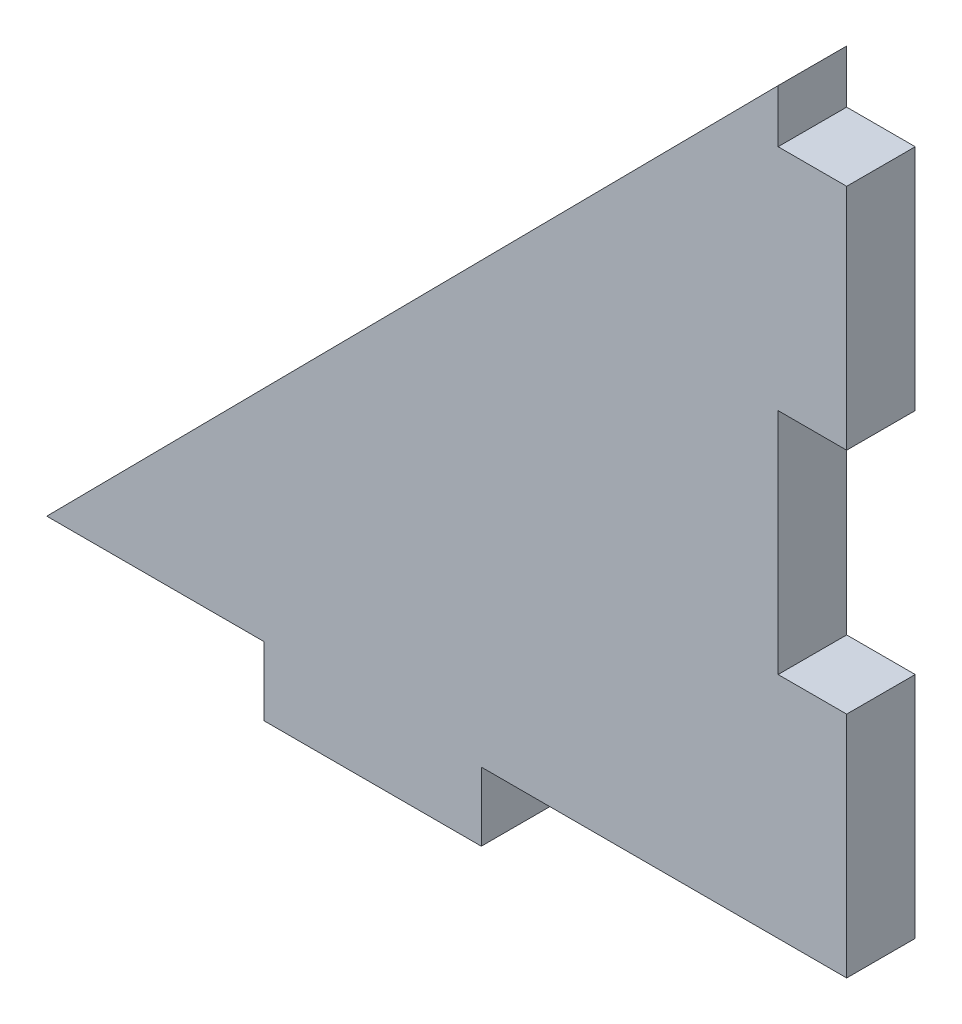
ISO-10303-21;
HEADER;
FILE_DESCRIPTION(('STEP AP214'),'2;1');
FILE_NAME('part.step','',(''),(''),'','','');
FILE_SCHEMA(('AUTOMOTIVE_DESIGN { 1 0 10303 214 1 1 1 1 }'));
ENDSEC;
DATA;
#1=APPLICATION_CONTEXT('core data for automotive mechanical design processes');
#2=APPLICATION_PROTOCOL_DEFINITION('international standard','automotive_design',2000,#1);
#3=PRODUCT_CONTEXT('',#1,'mechanical');
#4=PRODUCT('Part','Part','',(#3));
#5=PRODUCT_RELATED_PRODUCT_CATEGORY('part','',(#4));
#6=PRODUCT_DEFINITION_FORMATION('','',#4);
#7=PRODUCT_DEFINITION_CONTEXT('part definition',#1,'design');
#8=PRODUCT_DEFINITION('design','',#6,#7);
#9=PRODUCT_DEFINITION_SHAPE('','',#8);
#10=(LENGTH_UNIT() NAMED_UNIT(*) SI_UNIT(.MILLI.,.METRE.));
#11=(NAMED_UNIT(*) PLANE_ANGLE_UNIT() SI_UNIT($,.RADIAN.));
#12=(NAMED_UNIT(*) SI_UNIT($,.STERADIAN.) SOLID_ANGLE_UNIT());
#13=UNCERTAINTY_MEASURE_WITH_UNIT(LENGTH_MEASURE(1.E-05),#10,'distance_accuracy_value','');
#14=(GEOMETRIC_REPRESENTATION_CONTEXT(3) GLOBAL_UNCERTAINTY_ASSIGNED_CONTEXT((#13)) GLOBAL_UNIT_ASSIGNED_CONTEXT((#10,
#11,#12)) REPRESENTATION_CONTEXT('',''));
#15=CARTESIAN_POINT('',(0.,0.,0.));
#16=DIRECTION('',(0.,0.,1.));
#17=DIRECTION('',(1.,0.,0.));
#18=AXIS2_PLACEMENT_3D('',#15,#16,#17);
#19=CARTESIAN_POINT('',(0.,40.3163641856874,3.));
#20=DIRECTION('',(0.710576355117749,-0.703620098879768,0.));
#21=DIRECTION('',(0.703620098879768,0.710576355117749,0.));
#22=AXIS2_PLACEMENT_3D('',#19,#20,#21);
#23=PLANE('',#22);
#24=DIRECTION('',(-0.703620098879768,-0.710576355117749,0.));
#25=VECTOR('',#24,1.);
#26=CARTESIAN_POINT('',(0.,40.3163641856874,0.));
#27=LINE('',#26,#25);
#28=CARTESIAN_POINT('',(0.,40.3163641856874,0.));
#29=VERTEX_POINT('',#28);
#30=CARTESIAN_POINT('',(-32.,7.99999999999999,0.));
#31=VERTEX_POINT('',#30);
#32=EDGE_CURVE('E159',#29,#31,#27,.T.);
#33=ORIENTED_EDGE('',*,*,#32,.T.);
#34=DIRECTION('',(0.,0.,-1.));
#35=VECTOR('',#34,1.);
#36=CARTESIAN_POINT('',(-32.,7.99999999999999,3.));
#37=LINE('',#36,#35);
#38=CARTESIAN_POINT('',(-32.,7.99999999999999,3.));
#39=VERTEX_POINT('',#38);
#40=EDGE_CURVE('E11',#39,#31,#37,.T.);
#41=ORIENTED_EDGE('',*,*,#40,.F.);
#42=DIRECTION('',(-0.703620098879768,-0.710576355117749,0.));
#43=VECTOR('',#42,1.);
#44=CARTESIAN_POINT('',(0.,40.3163641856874,3.));
#45=LINE('',#44,#43);
#46=CARTESIAN_POINT('',(0.,40.3163641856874,3.));
#47=VERTEX_POINT('',#46);
#48=EDGE_CURVE('E184',#47,#39,#45,.T.);
#49=ORIENTED_EDGE('',*,*,#48,.F.);
#50=DIRECTION('',(0.,0.,-1.));
#51=VECTOR('',#50,1.);
#52=CARTESIAN_POINT('',(0.,40.3163641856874,3.));
#53=LINE('',#52,#51);
#54=EDGE_CURVE('E155',#47,#29,#53,.T.);
#55=ORIENTED_EDGE('',*,*,#54,.T.);
#56=EDGE_LOOP('',(#33,#41,#49,#55));
#57=FACE_BOUND('',#56,.T.);
#58=ADVANCED_FACE('F33',(#57),#23,.F.);
#59=CARTESIAN_POINT('',(-32.,7.99999999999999,3.));
#60=DIRECTION('',(0.,1.,0.));
#61=DIRECTION('',(0.,0.,1.));
#62=AXIS2_PLACEMENT_3D('',#59,#60,#61);
#63=PLANE('',#62);
#64=DIRECTION('',(1.,0.,0.));
#65=VECTOR('',#64,1.);
#66=CARTESIAN_POINT('',(-32.,7.99999999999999,0.));
#67=LINE('',#66,#65);
#68=CARTESIAN_POINT('',(-22.4928481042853,7.99999999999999,0.));
#69=VERTEX_POINT('',#68);
#70=EDGE_CURVE('E162',#31,#69,#67,.T.);
#71=ORIENTED_EDGE('',*,*,#70,.T.);
#72=DIRECTION('',(0.,0.,-1.));
#73=VECTOR('',#72,1.);
#74=CARTESIAN_POINT('',(-22.4928481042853,7.99999999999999,3.));
#75=LINE('',#74,#73);
#76=CARTESIAN_POINT('',(-22.4928481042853,7.99999999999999,3.));
#77=VERTEX_POINT('',#76);
#78=EDGE_CURVE('E41',#77,#69,#75,.T.);
#79=ORIENTED_EDGE('',*,*,#78,.F.);
#80=DIRECTION('',(1.,0.,0.));
#81=VECTOR('',#80,1.);
#82=CARTESIAN_POINT('',(-32.,7.99999999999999,3.));
#83=LINE('',#82,#81);
#84=EDGE_CURVE('E107',#39,#77,#83,.T.);
#85=ORIENTED_EDGE('',*,*,#84,.F.);
#86=ORIENTED_EDGE('',*,*,#40,.T.);
#87=EDGE_LOOP('',(#71,#79,#85,#86));
#88=FACE_BOUND('',#87,.T.);
#89=ADVANCED_FACE('F266',(#88),#63,.F.);
#90=CARTESIAN_POINT('',(-22.4928481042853,7.99999999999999,3.));
#91=DIRECTION('',(1.,0.,0.));
#92=DIRECTION('',(0.,0.,-1.));
#93=AXIS2_PLACEMENT_3D('',#90,#91,#92);
#94=PLANE('',#93);
#95=DIRECTION('',(0.,-1.,0.));
#96=VECTOR('',#95,1.);
#97=CARTESIAN_POINT('',(-22.4928481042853,7.99999999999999,0.));
#98=LINE('',#97,#96);
#99=CARTESIAN_POINT('',(-22.4928481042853,4.99999999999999,0.));
#100=VERTEX_POINT('',#99);
#101=EDGE_CURVE('E164',#69,#100,#98,.T.);
#102=ORIENTED_EDGE('',*,*,#101,.T.);
#103=DIRECTION('',(0.,0.,-1.));
#104=VECTOR('',#103,1.);
#105=CARTESIAN_POINT('',(-22.4928481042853,4.99999999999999,3.));
#106=LINE('',#105,#104);
#107=CARTESIAN_POINT('',(-22.4928481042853,4.99999999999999,3.));
#108=VERTEX_POINT('',#107);
#109=EDGE_CURVE('E206',#108,#100,#106,.T.);
#110=ORIENTED_EDGE('',*,*,#109,.F.);
#111=DIRECTION('',(0.,-1.,0.));
#112=VECTOR('',#111,1.);
#113=CARTESIAN_POINT('',(-22.4928481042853,7.99999999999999,3.));
#114=LINE('',#113,#112);
#115=EDGE_CURVE('E214',#77,#108,#114,.T.);
#116=ORIENTED_EDGE('',*,*,#115,.F.);
#117=ORIENTED_EDGE('',*,*,#78,.T.);
#118=EDGE_LOOP('',(#102,#110,#116,#117));
#119=FACE_BOUND('',#118,.T.);
#120=ADVANCED_FACE('F212',(#119),#94,.F.);
#121=CARTESIAN_POINT('',(-22.4928481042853,4.99999999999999,3.));
#122=DIRECTION('',(0.,1.,0.));
#123=DIRECTION('',(-1.,0.,0.));
#124=AXIS2_PLACEMENT_3D('',#121,#122,#123);
#125=PLANE('',#124);
#126=DIRECTION('',(1.,0.,0.));
#127=VECTOR('',#126,1.);
#128=CARTESIAN_POINT('',(-22.4928481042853,4.99999999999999,0.));
#129=LINE('',#128,#127);
#130=CARTESIAN_POINT('',(-12.9860055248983,4.99999999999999,0.));
#131=VERTEX_POINT('',#130);
#132=EDGE_CURVE('E166',#100,#131,#129,.T.);
#133=ORIENTED_EDGE('',*,*,#132,.T.);
#134=DIRECTION('',(0.,0.,-1.));
#135=VECTOR('',#134,1.);
#136=CARTESIAN_POINT('',(-12.9860055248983,4.99999999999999,3.));
#137=LINE('',#136,#135);
#138=CARTESIAN_POINT('',(-12.9860055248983,4.99999999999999,3.));
#139=VERTEX_POINT('',#138);
#140=EDGE_CURVE('E203',#139,#131,#137,.T.);
#141=ORIENTED_EDGE('',*,*,#140,.F.);
#142=DIRECTION('',(1.,0.,0.));
#143=VECTOR('',#142,1.);
#144=CARTESIAN_POINT('',(-22.4928481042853,4.99999999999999,3.));
#145=LINE('',#144,#143);
#146=EDGE_CURVE('E231',#108,#139,#145,.T.);
#147=ORIENTED_EDGE('',*,*,#146,.F.);
#148=ORIENTED_EDGE('',*,*,#109,.T.);
#149=EDGE_LOOP('',(#133,#141,#147,#148));
#150=FACE_BOUND('',#149,.T.);
#151=ADVANCED_FACE('F222',(#150),#125,.F.);
#152=CARTESIAN_POINT('',(-12.9860055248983,4.99999999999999,3.));
#153=DIRECTION('',(-1.,0.,0.));
#154=DIRECTION('',(0.,0.,1.));
#155=AXIS2_PLACEMENT_3D('',#152,#153,#154);
#156=PLANE('',#155);
#157=DIRECTION('',(0.,1.,0.));
#158=VECTOR('',#157,1.);
#159=CARTESIAN_POINT('',(-12.9860055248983,4.99999999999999,0.));
#160=LINE('',#159,#158);
#161=CARTESIAN_POINT('',(-12.9860055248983,7.99999999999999,0.));
#162=VERTEX_POINT('',#161);
#163=EDGE_CURVE('E168',#131,#162,#160,.T.);
#164=ORIENTED_EDGE('',*,*,#163,.T.);
#165=DIRECTION('',(0.,0.,-1.));
#166=VECTOR('',#165,1.);
#167=CARTESIAN_POINT('',(-12.9860055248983,7.99999999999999,3.));
#168=LINE('',#167,#166);
#169=CARTESIAN_POINT('',(-12.9860055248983,7.99999999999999,3.));
#170=VERTEX_POINT('',#169);
#171=EDGE_CURVE('E200',#170,#162,#168,.T.);
#172=ORIENTED_EDGE('',*,*,#171,.F.);
#173=DIRECTION('',(0.,1.,0.));
#174=VECTOR('',#173,1.);
#175=CARTESIAN_POINT('',(-12.9860055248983,4.99999999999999,3.));
#176=LINE('',#175,#174);
#177=EDGE_CURVE('E228',#139,#170,#176,.T.);
#178=ORIENTED_EDGE('',*,*,#177,.F.);
#179=ORIENTED_EDGE('',*,*,#140,.T.);
#180=EDGE_LOOP('',(#164,#172,#178,#179));
#181=FACE_BOUND('',#180,.T.);
#182=ADVANCED_FACE('F226',(#181),#156,.F.);
#183=CARTESIAN_POINT('',(0.,7.99999999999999,3.));
#184=DIRECTION('',(0.,1.,0.));
#185=DIRECTION('',(0.,0.,1.));
#186=AXIS2_PLACEMENT_3D('',#183,#184,#185);
#187=PLANE('',#186);
#188=DIRECTION('',(1.,0.,0.));
#189=VECTOR('',#188,1.);
#190=CARTESIAN_POINT('',(0.,7.99999999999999,0.));
#191=LINE('',#190,#189);
#192=CARTESIAN_POINT('',(3.,7.99999999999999,0.));
#193=VERTEX_POINT('',#192);
#194=EDGE_CURVE('E171',#162,#193,#191,.T.);
#195=ORIENTED_EDGE('',*,*,#194,.T.);
#196=DIRECTION('',(0.,0.,-1.));
#197=VECTOR('',#196,1.);
#198=CARTESIAN_POINT('',(3.,7.99999999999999,3.));
#199=LINE('',#198,#197);
#200=CARTESIAN_POINT('',(3.,7.99999999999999,3.));
#201=VERTEX_POINT('',#200);
#202=EDGE_CURVE('E197',#201,#193,#199,.T.);
#203=ORIENTED_EDGE('',*,*,#202,.F.);
#204=DIRECTION('',(1.,0.,0.));
#205=VECTOR('',#204,1.);
#206=CARTESIAN_POINT('',(-12.9860055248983,7.99999999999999,3.));
#207=LINE('',#206,#205);
#208=EDGE_CURVE('E230',#170,#201,#207,.T.);
#209=ORIENTED_EDGE('',*,*,#208,.F.);
#210=ORIENTED_EDGE('',*,*,#171,.T.);
#211=EDGE_LOOP('',(#195,#203,#209,#210));
#212=FACE_BOUND('',#211,.T.);
#213=ADVANCED_FACE('F279',(#212),#187,.F.);
#214=CARTESIAN_POINT('',(3.,7.99999999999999,3.));
#215=DIRECTION('',(-1.,0.,0.));
#216=DIRECTION('',(0.,0.,1.));
#217=AXIS2_PLACEMENT_3D('',#214,#215,#216);
#218=PLANE('',#217);
#219=DIRECTION('',(0.,1.,0.));
#220=VECTOR('',#219,1.);
#221=CARTESIAN_POINT('',(3.,7.99999999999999,0.));
#222=LINE('',#221,#220);
#223=CARTESIAN_POINT('',(3.,18.,0.));
#224=VERTEX_POINT('',#223);
#225=EDGE_CURVE('E173',#193,#224,#222,.T.);
#226=ORIENTED_EDGE('',*,*,#225,.T.);
#227=DIRECTION('',(0.,0.,-1.));
#228=VECTOR('',#227,1.);
#229=CARTESIAN_POINT('',(3.,18.,3.));
#230=LINE('',#229,#228);
#231=CARTESIAN_POINT('',(3.,18.,3.));
#232=VERTEX_POINT('',#231);
#233=EDGE_CURVE('E194',#232,#224,#230,.T.);
#234=ORIENTED_EDGE('',*,*,#233,.F.);
#235=DIRECTION('',(0.,1.,0.));
#236=VECTOR('',#235,1.);
#237=CARTESIAN_POINT('',(3.,7.99999999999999,3.));
#238=LINE('',#237,#236);
#239=EDGE_CURVE('E233',#201,#232,#238,.T.);
#240=ORIENTED_EDGE('',*,*,#239,.F.);
#241=ORIENTED_EDGE('',*,*,#202,.T.);
#242=EDGE_LOOP('',(#226,#234,#240,#241));
#243=FACE_BOUND('',#242,.T.);
#244=ADVANCED_FACE('F282',(#243),#218,.F.);
#245=CARTESIAN_POINT('',(3.,18.,3.));
#246=DIRECTION('',(0.,-1.,0.));
#247=DIRECTION('',(0.,0.,-1.));
#248=AXIS2_PLACEMENT_3D('',#245,#246,#247);
#249=PLANE('',#248);
#250=DIRECTION('',(-1.,0.,0.));
#251=VECTOR('',#250,1.);
#252=CARTESIAN_POINT('',(3.,18.,0.));
#253=LINE('',#252,#251);
#254=CARTESIAN_POINT('',(0.,18.,0.));
#255=VERTEX_POINT('',#254);
#256=EDGE_CURVE('E175',#224,#255,#253,.T.);
#257=ORIENTED_EDGE('',*,*,#256,.T.);
#258=DIRECTION('',(0.,0.,-1.));
#259=VECTOR('',#258,1.);
#260=CARTESIAN_POINT('',(0.,18.,3.));
#261=LINE('',#260,#259);
#262=CARTESIAN_POINT('',(0.,18.,3.));
#263=VERTEX_POINT('',#262);
#264=EDGE_CURVE('E191',#263,#255,#261,.T.);
#265=ORIENTED_EDGE('',*,*,#264,.F.);
#266=DIRECTION('',(-1.,0.,0.));
#267=VECTOR('',#266,1.);
#268=CARTESIAN_POINT('',(3.,18.,3.));
#269=LINE('',#268,#267);
#270=EDGE_CURVE('E239',#232,#263,#269,.T.);
#271=ORIENTED_EDGE('',*,*,#270,.F.);
#272=ORIENTED_EDGE('',*,*,#233,.T.);
#273=EDGE_LOOP('',(#257,#265,#271,#272));
#274=FACE_BOUND('',#273,.T.);
#275=ADVANCED_FACE('F286',(#274),#249,.F.);
#276=CARTESIAN_POINT('',(0.,18.,3.));
#277=DIRECTION('',(-1.,0.,0.));
#278=DIRECTION('',(0.,0.,1.));
#279=AXIS2_PLACEMENT_3D('',#276,#277,#278);
#280=PLANE('',#279);
#281=DIRECTION('',(0.,1.,0.));
#282=VECTOR('',#281,1.);
#283=CARTESIAN_POINT('',(0.,18.,0.));
#284=LINE('',#283,#282);
#285=CARTESIAN_POINT('',(0.,28.,0.));
#286=VERTEX_POINT('',#285);
#287=EDGE_CURVE('E177',#255,#286,#284,.T.);
#288=ORIENTED_EDGE('',*,*,#287,.T.);
#289=DIRECTION('',(0.,0.,-1.));
#290=VECTOR('',#289,1.);
#291=CARTESIAN_POINT('',(0.,28.,3.));
#292=LINE('',#291,#290);
#293=CARTESIAN_POINT('',(0.,28.,3.));
#294=VERTEX_POINT('',#293);
#295=EDGE_CURVE('E188',#294,#286,#292,.T.);
#296=ORIENTED_EDGE('',*,*,#295,.F.);
#297=DIRECTION('',(0.,1.,0.));
#298=VECTOR('',#297,1.);
#299=CARTESIAN_POINT('',(0.,18.,3.));
#300=LINE('',#299,#298);
#301=EDGE_CURVE('E241',#263,#294,#300,.T.);
#302=ORIENTED_EDGE('',*,*,#301,.F.);
#303=ORIENTED_EDGE('',*,*,#264,.T.);
#304=EDGE_LOOP('',(#288,#296,#302,#303));
#305=FACE_BOUND('',#304,.T.);
#306=ADVANCED_FACE('F247',(#305),#280,.F.);
#307=CARTESIAN_POINT('',(0.,28.,3.));
#308=DIRECTION('',(0.,1.,0.));
#309=DIRECTION('',(0.,0.,1.));
#310=AXIS2_PLACEMENT_3D('',#307,#308,#309);
#311=PLANE('',#310);
#312=DIRECTION('',(1.,0.,0.));
#313=VECTOR('',#312,1.);
#314=CARTESIAN_POINT('',(0.,28.,0.));
#315=LINE('',#314,#313);
#316=CARTESIAN_POINT('',(3.,28.,0.));
#317=VERTEX_POINT('',#316);
#318=EDGE_CURVE('E179',#286,#317,#315,.T.);
#319=ORIENTED_EDGE('',*,*,#318,.T.);
#320=DIRECTION('',(0.,0.,-1.));
#321=VECTOR('',#320,1.);
#322=CARTESIAN_POINT('',(3.,28.,3.));
#323=LINE('',#322,#321);
#324=CARTESIAN_POINT('',(3.,28.,3.));
#325=VERTEX_POINT('',#324);
#326=EDGE_CURVE('E150',#325,#317,#323,.T.);
#327=ORIENTED_EDGE('',*,*,#326,.F.);
#328=DIRECTION('',(1.,0.,0.));
#329=VECTOR('',#328,1.);
#330=CARTESIAN_POINT('',(0.,28.,3.));
#331=LINE('',#330,#329);
#332=EDGE_CURVE('E141',#294,#325,#331,.T.);
#333=ORIENTED_EDGE('',*,*,#332,.F.);
#334=ORIENTED_EDGE('',*,*,#295,.T.);
#335=EDGE_LOOP('',(#319,#327,#333,#334));
#336=FACE_BOUND('',#335,.T.);
#337=ADVANCED_FACE('F251',(#336),#311,.F.);
#338=CARTESIAN_POINT('',(3.,28.,3.));
#339=DIRECTION('',(-1.,0.,0.));
#340=DIRECTION('',(0.,0.,1.));
#341=AXIS2_PLACEMENT_3D('',#338,#339,#340);
#342=PLANE('',#341);
#343=DIRECTION('',(0.,1.,0.));
#344=VECTOR('',#343,1.);
#345=CARTESIAN_POINT('',(3.,28.,0.));
#346=LINE('',#345,#344);
#347=CARTESIAN_POINT('',(3.,38.,0.));
#348=VERTEX_POINT('',#347);
#349=EDGE_CURVE('E149',#317,#348,#346,.T.);
#350=ORIENTED_EDGE('',*,*,#349,.T.);
#351=DIRECTION('',(0.,0.,-1.));
#352=VECTOR('',#351,1.);
#353=CARTESIAN_POINT('',(3.,38.,3.));
#354=LINE('',#353,#352);
#355=CARTESIAN_POINT('',(3.,38.,3.));
#356=VERTEX_POINT('',#355);
#357=EDGE_CURVE('E146',#356,#348,#354,.T.);
#358=ORIENTED_EDGE('',*,*,#357,.F.);
#359=DIRECTION('',(0.,1.,0.));
#360=VECTOR('',#359,1.);
#361=CARTESIAN_POINT('',(3.,28.,3.));
#362=LINE('',#361,#360);
#363=EDGE_CURVE('E135',#325,#356,#362,.T.);
#364=ORIENTED_EDGE('',*,*,#363,.F.);
#365=ORIENTED_EDGE('',*,*,#326,.T.);
#366=EDGE_LOOP('',(#350,#358,#364,#365));
#367=FACE_BOUND('',#366,.T.);
#368=ADVANCED_FACE('F147',(#367),#342,.F.);
#369=CARTESIAN_POINT('',(3.,38.,3.));
#370=DIRECTION('',(0.,-1.,0.));
#371=DIRECTION('',(0.,0.,-1.));
#372=AXIS2_PLACEMENT_3D('',#369,#370,#371);
#373=PLANE('',#372);
#374=DIRECTION('',(-1.,0.,0.));
#375=VECTOR('',#374,1.);
#376=CARTESIAN_POINT('',(3.,38.,0.));
#377=LINE('',#376,#375);
#378=CARTESIAN_POINT('',(0.,38.,0.));
#379=VERTEX_POINT('',#378);
#380=EDGE_CURVE('E93',#348,#379,#377,.T.);
#381=ORIENTED_EDGE('',*,*,#380,.T.);
#382=DIRECTION('',(0.,0.,-1.));
#383=VECTOR('',#382,1.);
#384=CARTESIAN_POINT('',(0.,38.,3.));
#385=LINE('',#384,#383);
#386=CARTESIAN_POINT('',(0.,38.,3.));
#387=VERTEX_POINT('',#386);
#388=EDGE_CURVE('E151',#387,#379,#385,.T.);
#389=ORIENTED_EDGE('',*,*,#388,.F.);
#390=DIRECTION('',(-1.,0.,0.));
#391=VECTOR('',#390,1.);
#392=CARTESIAN_POINT('',(3.,38.,3.));
#393=LINE('',#392,#391);
#394=EDGE_CURVE('E139',#356,#387,#393,.T.);
#395=ORIENTED_EDGE('',*,*,#394,.F.);
#396=ORIENTED_EDGE('',*,*,#357,.T.);
#397=EDGE_LOOP('',(#381,#389,#395,#396));
#398=FACE_BOUND('',#397,.T.);
#399=ADVANCED_FACE('F153',(#398),#373,.F.);
#400=CARTESIAN_POINT('',(0.,38.,3.));
#401=DIRECTION('',(-1.,0.,0.));
#402=DIRECTION('',(0.,0.,1.));
#403=AXIS2_PLACEMENT_3D('',#400,#401,#402);
#404=PLANE('',#403);
#405=DIRECTION('',(0.,1.,0.));
#406=VECTOR('',#405,1.);
#407=CARTESIAN_POINT('',(0.,38.,0.));
#408=LINE('',#407,#406);
#409=EDGE_CURVE('E99',#379,#29,#408,.T.);
#410=ORIENTED_EDGE('',*,*,#409,.T.);
#411=ORIENTED_EDGE('',*,*,#54,.F.);
#412=DIRECTION('',(0.,1.,0.));
#413=VECTOR('',#412,1.);
#414=CARTESIAN_POINT('',(0.,38.,3.));
#415=LINE('',#414,#413);
#416=EDGE_CURVE('E49',#387,#47,#415,.T.);
#417=ORIENTED_EDGE('',*,*,#416,.F.);
#418=ORIENTED_EDGE('',*,*,#388,.T.);
#419=EDGE_LOOP('',(#410,#411,#417,#418));
#420=FACE_BOUND('',#419,.T.);
#421=ADVANCED_FACE('F255',(#420),#404,.F.);
#422=CARTESIAN_POINT('',(0.,0.,3.));
#423=DIRECTION('',(0.,0.,1.));
#424=DIRECTION('',(1.,0.,0.));
#425=AXIS2_PLACEMENT_3D('',#422,#423,#424);
#426=PLANE('',#425);
#427=ORIENTED_EDGE('',*,*,#48,.T.);
#428=ORIENTED_EDGE('',*,*,#84,.T.);
#429=ORIENTED_EDGE('',*,*,#115,.T.);
#430=ORIENTED_EDGE('',*,*,#146,.T.);
#431=ORIENTED_EDGE('',*,*,#177,.T.);
#432=ORIENTED_EDGE('',*,*,#208,.T.);
#433=ORIENTED_EDGE('',*,*,#239,.T.);
#434=ORIENTED_EDGE('',*,*,#270,.T.);
#435=ORIENTED_EDGE('',*,*,#301,.T.);
#436=ORIENTED_EDGE('',*,*,#332,.T.);
#437=ORIENTED_EDGE('',*,*,#363,.T.);
#438=ORIENTED_EDGE('',*,*,#394,.T.);
#439=ORIENTED_EDGE('',*,*,#416,.T.);
#440=EDGE_LOOP('',(#427,#428,#429,#430,#431,#432,#433,#434,#435,#436,#437,#438,#439));
#441=FACE_BOUND('',#440,.T.);
#442=ADVANCED_FACE('F137',(#441),#426,.T.);
#443=CARTESIAN_POINT('',(0.,0.,0.));
#444=DIRECTION('',(0.,0.,1.));
#445=DIRECTION('',(1.,0.,0.));
#446=AXIS2_PLACEMENT_3D('',#443,#444,#445);
#447=PLANE('',#446);
#448=ORIENTED_EDGE('',*,*,#32,.F.);
#449=ORIENTED_EDGE('',*,*,#409,.F.);
#450=ORIENTED_EDGE('',*,*,#380,.F.);
#451=ORIENTED_EDGE('',*,*,#349,.F.);
#452=ORIENTED_EDGE('',*,*,#318,.F.);
#453=ORIENTED_EDGE('',*,*,#287,.F.);
#454=ORIENTED_EDGE('',*,*,#256,.F.);
#455=ORIENTED_EDGE('',*,*,#225,.F.);
#456=ORIENTED_EDGE('',*,*,#194,.F.);
#457=ORIENTED_EDGE('',*,*,#163,.F.);
#458=ORIENTED_EDGE('',*,*,#132,.F.);
#459=ORIENTED_EDGE('',*,*,#101,.F.);
#460=ORIENTED_EDGE('',*,*,#70,.F.);
#461=EDGE_LOOP('',(#448,#449,#450,#451,#452,#453,#454,#455,#456,#457,#458,#459,#460));
#462=FACE_BOUND('',#461,.T.);
#463=ADVANCED_FACE('F218',(#462),#447,.F.);
#464=CLOSED_SHELL('',(#58,#89,#120,#151,#182,#213,#244,#275,#306,#337,#368,#399,#421,#442,#463));
#465=MANIFOLD_SOLID_BREP('B2',#464);
#466=ADVANCED_BREP_SHAPE_REPRESENTATION('',(#18,#465),#14);
#467=SHAPE_DEFINITION_REPRESENTATION(#9,#466);
ENDSEC;
END-ISO-10303-21;
